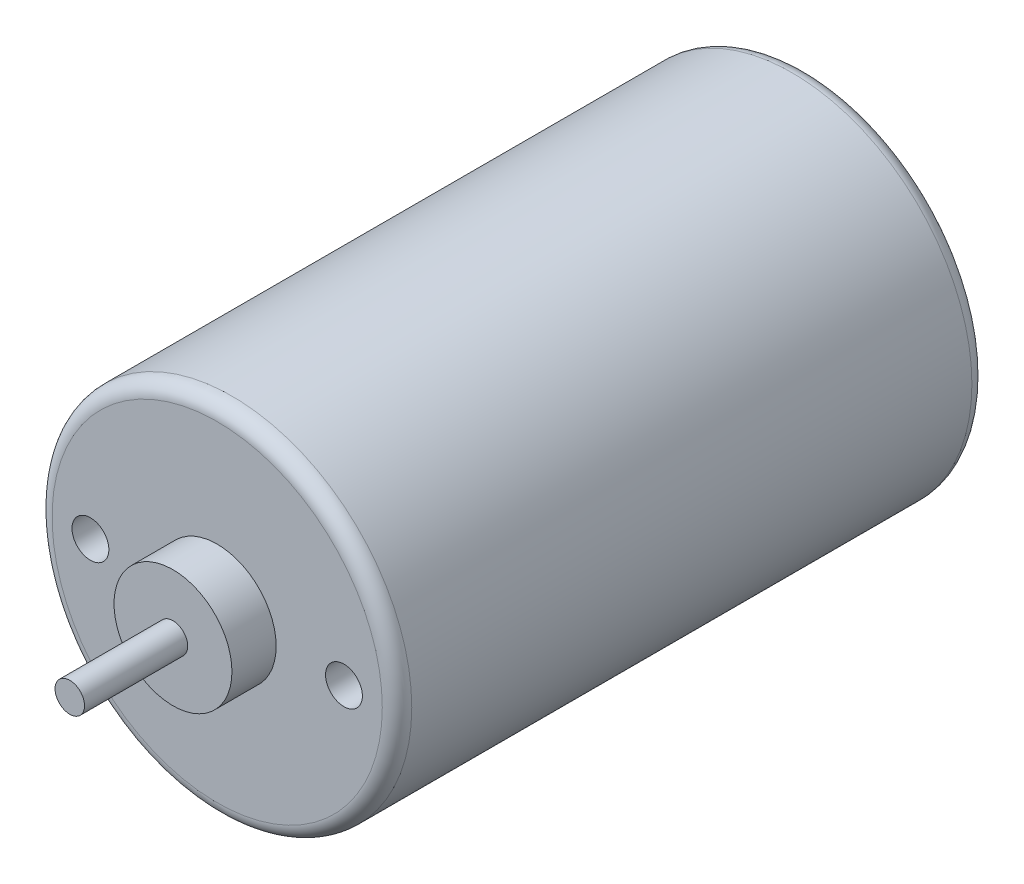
ISO-10303-21;
HEADER;
FILE_DESCRIPTION(('STEP AP214'),'2;1');
FILE_NAME('part.step','',(''),(''),'','','');
FILE_SCHEMA(('AUTOMOTIVE_DESIGN { 1 0 10303 214 1 1 1 1 }'));
ENDSEC;
DATA;
#1=APPLICATION_CONTEXT('core data for automotive mechanical design processes');
#2=APPLICATION_PROTOCOL_DEFINITION('international standard','automotive_design',2000,#1);
#3=PRODUCT_CONTEXT('',#1,'mechanical');
#4=PRODUCT('Part','Part','',(#3));
#5=PRODUCT_RELATED_PRODUCT_CATEGORY('part','',(#4));
#6=PRODUCT_DEFINITION_FORMATION('','',#4);
#7=PRODUCT_DEFINITION_CONTEXT('part definition',#1,'design');
#8=PRODUCT_DEFINITION('design','',#6,#7);
#9=PRODUCT_DEFINITION_SHAPE('','',#8);
#10=(LENGTH_UNIT() NAMED_UNIT(*) SI_UNIT(.MILLI.,.METRE.));
#11=(NAMED_UNIT(*) PLANE_ANGLE_UNIT() SI_UNIT($,.RADIAN.));
#12=(NAMED_UNIT(*) SI_UNIT($,.STERADIAN.) SOLID_ANGLE_UNIT());
#13=UNCERTAINTY_MEASURE_WITH_UNIT(LENGTH_MEASURE(1.E-05),#10,'distance_accuracy_value','');
#14=(GEOMETRIC_REPRESENTATION_CONTEXT(3) GLOBAL_UNCERTAINTY_ASSIGNED_CONTEXT((#13)) GLOBAL_UNIT_ASSIGNED_CONTEXT((#10,
#11,#12)) REPRESENTATION_CONTEXT('',''));
#15=CARTESIAN_POINT('',(0.,0.,0.));
#16=DIRECTION('',(0.,0.,1.));
#17=DIRECTION('',(1.,0.,0.));
#18=AXIS2_PLACEMENT_3D('',#15,#16,#17);
#19=CARTESIAN_POINT('',(0.,0.,40.));
#20=DIRECTION('',(0.,0.,-1.));
#21=DIRECTION('',(-1.,0.,0.));
#22=AXIS2_PLACEMENT_3D('',#19,#20,#21);
#23=CYLINDRICAL_SURFACE('',#22,12.2);
#24=CARTESIAN_POINT('',(0.,0.,1.));
#25=DIRECTION('',(0.,0.,1.));
#26=DIRECTION('',(1.,0.,0.));
#27=AXIS2_PLACEMENT_3D('',#24,#25,#26);
#28=CIRCLE('',#27,12.2);
#29=CARTESIAN_POINT('',(12.2,0.,1.));
#30=VERTEX_POINT('',#29);
#31=EDGE_CURVE('E46',#30,#30,#28,.T.);
#32=ORIENTED_EDGE('',*,*,#31,.T.);
#33=EDGE_LOOP('',(#32));
#34=FACE_BOUND('',#33,.T.);
#35=CARTESIAN_POINT('',(0.,0.,39.));
#36=DIRECTION('',(0.,0.,1.));
#37=DIRECTION('',(1.,0.,0.));
#38=AXIS2_PLACEMENT_3D('',#35,#36,#37);
#39=CIRCLE('',#38,12.2);
#40=CARTESIAN_POINT('',(12.2,0.,39.));
#41=VERTEX_POINT('',#40);
#42=EDGE_CURVE('E88',#41,#41,#39,.F.);
#43=ORIENTED_EDGE('',*,*,#42,.T.);
#44=EDGE_LOOP('',(#43));
#45=FACE_BOUND('',#44,.T.);
#46=ADVANCED_FACE('F38',(#34,#45),#23,.T.);
#47=CARTESIAN_POINT('',(0.,0.,40.));
#48=DIRECTION('',(0.,0.,1.));
#49=DIRECTION('',(1.,0.,0.));
#50=AXIS2_PLACEMENT_3D('',#47,#48,#49);
#51=PLANE('',#50);
#52=CARTESIAN_POINT('',(0.,0.,40.));
#53=DIRECTION('',(0.,0.,1.));
#54=DIRECTION('',(1.,0.,0.));
#55=AXIS2_PLACEMENT_3D('',#52,#53,#54);
#56=CIRCLE('',#55,11.2);
#57=CARTESIAN_POINT('',(11.2,0.,40.));
#58=VERTEX_POINT('',#57);
#59=EDGE_CURVE('E80',#58,#58,#56,.T.);
#60=ORIENTED_EDGE('',*,*,#59,.T.);
#61=EDGE_LOOP('',(#60));
#62=FACE_BOUND('',#61,.T.);
#63=CARTESIAN_POINT('',(-8.6,0.,40.));
#64=DIRECTION('',(0.,0.,1.));
#65=DIRECTION('',(1.,0.,0.));
#66=AXIS2_PLACEMENT_3D('',#63,#64,#65);
#67=CIRCLE('',#66,1.24999999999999);
#68=CARTESIAN_POINT('',(-7.35000000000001,0.,40.));
#69=VERTEX_POINT('',#68);
#70=EDGE_CURVE('E63',#69,#69,#67,.T.);
#71=ORIENTED_EDGE('',*,*,#70,.F.);
#72=EDGE_LOOP('',(#71));
#73=FACE_BOUND('',#72,.T.);
#74=CARTESIAN_POINT('',(8.6,0.,40.));
#75=DIRECTION('',(0.,0.,1.));
#76=DIRECTION('',(1.,0.,0.));
#77=AXIS2_PLACEMENT_3D('',#74,#75,#76);
#78=CIRCLE('',#77,1.24999999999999);
#79=CARTESIAN_POINT('',(9.84999999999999,0.,40.));
#80=VERTEX_POINT('',#79);
#81=EDGE_CURVE('E62',#80,#80,#78,.T.);
#82=ORIENTED_EDGE('',*,*,#81,.F.);
#83=EDGE_LOOP('',(#82));
#84=FACE_BOUND('',#83,.T.);
#85=CARTESIAN_POINT('',(0.,0.,40.));
#86=DIRECTION('',(0.,0.,1.));
#87=DIRECTION('',(1.,0.,0.));
#88=AXIS2_PLACEMENT_3D('',#85,#86,#87);
#89=CIRCLE('',#88,4.);
#90=CARTESIAN_POINT('',(4.,0.,40.));
#91=VERTEX_POINT('',#90);
#92=EDGE_CURVE('E81',#91,#91,#89,.T.);
#93=ORIENTED_EDGE('',*,*,#92,.F.);
#94=EDGE_LOOP('',(#93));
#95=FACE_BOUND('',#94,.T.);
#96=ADVANCED_FACE('F104',(#62,#73,#84,#95),#51,.T.);
#97=CARTESIAN_POINT('',(0.,0.,0.));
#98=DIRECTION('',(0.,0.,1.));
#99=DIRECTION('',(1.,0.,0.));
#100=AXIS2_PLACEMENT_3D('',#97,#98,#99);
#101=PLANE('',#100);
#102=CARTESIAN_POINT('',(0.,0.,0.));
#103=DIRECTION('',(0.,0.,1.));
#104=DIRECTION('',(1.,0.,0.));
#105=AXIS2_PLACEMENT_3D('',#102,#103,#104);
#106=CIRCLE('',#105,11.2);
#107=CARTESIAN_POINT('',(11.2,0.,0.));
#108=VERTEX_POINT('',#107);
#109=EDGE_CURVE('E11',#108,#108,#106,.F.);
#110=ORIENTED_EDGE('',*,*,#109,.T.);
#111=EDGE_LOOP('',(#110));
#112=FACE_BOUND('',#111,.T.);
#113=ADVANCED_FACE('F109',(#112),#101,.F.);
#114=CARTESIAN_POINT('',(0.,0.,43.));
#115=DIRECTION('',(0.,0.,-1.));
#116=DIRECTION('',(-1.,0.,0.));
#117=AXIS2_PLACEMENT_3D('',#114,#115,#116);
#118=CYLINDRICAL_SURFACE('',#117,4.);
#119=CARTESIAN_POINT('',(0.,0.,43.));
#120=DIRECTION('',(0.,0.,1.));
#121=DIRECTION('',(1.,0.,0.));
#122=AXIS2_PLACEMENT_3D('',#119,#120,#121);
#123=CIRCLE('',#122,4.);
#124=CARTESIAN_POINT('',(4.,0.,43.));
#125=VERTEX_POINT('',#124);
#126=EDGE_CURVE('E76',#125,#125,#123,.T.);
#127=ORIENTED_EDGE('',*,*,#126,.F.);
#128=EDGE_LOOP('',(#127));
#129=FACE_BOUND('',#128,.T.);
#130=ORIENTED_EDGE('',*,*,#92,.T.);
#131=EDGE_LOOP('',(#130));
#132=FACE_BOUND('',#131,.T.);
#133=ADVANCED_FACE('F114',(#129,#132),#118,.T.);
#134=CARTESIAN_POINT('',(0.,0.,43.));
#135=DIRECTION('',(0.,0.,1.));
#136=DIRECTION('',(1.,0.,0.));
#137=AXIS2_PLACEMENT_3D('',#134,#135,#136);
#138=PLANE('',#137);
#139=CARTESIAN_POINT('',(0.,0.,43.));
#140=DIRECTION('',(0.,0.,1.));
#141=DIRECTION('',(1.,0.,0.));
#142=AXIS2_PLACEMENT_3D('',#139,#140,#141);
#143=CIRCLE('',#142,1.);
#144=CARTESIAN_POINT('',(1.,0.,43.));
#145=VERTEX_POINT('',#144);
#146=EDGE_CURVE('E77',#145,#145,#143,.T.);
#147=ORIENTED_EDGE('',*,*,#146,.F.);
#148=EDGE_LOOP('',(#147));
#149=FACE_BOUND('',#148,.T.);
#150=ORIENTED_EDGE('',*,*,#126,.T.);
#151=EDGE_LOOP('',(#150));
#152=FACE_BOUND('',#151,.T.);
#153=ADVANCED_FACE('F119',(#149,#152),#138,.T.);
#154=CARTESIAN_POINT('',(0.,0.,50.));
#155=DIRECTION('',(0.,0.,-1.));
#156=DIRECTION('',(-1.,0.,0.));
#157=AXIS2_PLACEMENT_3D('',#154,#155,#156);
#158=CYLINDRICAL_SURFACE('',#157,1.);
#159=CARTESIAN_POINT('',(0.,0.,50.));
#160=DIRECTION('',(0.,0.,1.));
#161=DIRECTION('',(1.,0.,0.));
#162=AXIS2_PLACEMENT_3D('',#159,#160,#161);
#163=CIRCLE('',#162,1.);
#164=CARTESIAN_POINT('',(1.,0.,50.));
#165=VERTEX_POINT('',#164);
#166=EDGE_CURVE('E73',#165,#165,#163,.T.);
#167=ORIENTED_EDGE('',*,*,#166,.F.);
#168=EDGE_LOOP('',(#167));
#169=FACE_BOUND('',#168,.T.);
#170=ORIENTED_EDGE('',*,*,#146,.T.);
#171=EDGE_LOOP('',(#170));
#172=FACE_BOUND('',#171,.T.);
#173=ADVANCED_FACE('F123',(#169,#172),#158,.T.);
#174=CARTESIAN_POINT('',(0.,0.,50.));
#175=DIRECTION('',(0.,0.,1.));
#176=DIRECTION('',(1.,0.,0.));
#177=AXIS2_PLACEMENT_3D('',#174,#175,#176);
#178=PLANE('',#177);
#179=ORIENTED_EDGE('',*,*,#166,.T.);
#180=EDGE_LOOP('',(#179));
#181=FACE_BOUND('',#180,.T.);
#182=ADVANCED_FACE('F127',(#181),#178,.T.);
#183=CARTESIAN_POINT('',(8.6,0.,36.));
#184=DIRECTION('',(0.,0.,1.));
#185=DIRECTION('',(1.,0.,0.));
#186=AXIS2_PLACEMENT_3D('',#183,#184,#185);
#187=CONICAL_SURFACE('',#186,1.25,1.02974425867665);
#188=CARTESIAN_POINT('',(8.6,0.,35.2489242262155));
#189=VERTEX_POINT('',#188);
#190=VERTEX_LOOP('',#189);
#191=FACE_BOUND('',#190,.T.);
#192=CARTESIAN_POINT('',(8.6,0.,36.));
#193=DIRECTION('',(0.,0.,1.));
#194=DIRECTION('',(1.,0.,0.));
#195=AXIS2_PLACEMENT_3D('',#192,#193,#194);
#196=CIRCLE('',#195,1.25);
#197=CARTESIAN_POINT('',(9.85,0.,36.));
#198=VERTEX_POINT('',#197);
#199=EDGE_CURVE('E66',#198,#198,#196,.T.);
#200=ORIENTED_EDGE('',*,*,#199,.T.);
#201=EDGE_LOOP('',(#200));
#202=FACE_BOUND('',#201,.T.);
#203=ADVANCED_FACE('F131',(#191,#202),#187,.F.);
#204=CARTESIAN_POINT('',(8.6,0.,40.));
#205=DIRECTION('',(0.,0.,1.));
#206=DIRECTION('',(1.,0.,0.));
#207=AXIS2_PLACEMENT_3D('',#204,#205,#206);
#208=CYLINDRICAL_SURFACE('',#207,1.24999999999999);
#209=ORIENTED_EDGE('',*,*,#199,.F.);
#210=EDGE_LOOP('',(#209));
#211=FACE_BOUND('',#210,.T.);
#212=ORIENTED_EDGE('',*,*,#81,.T.);
#213=EDGE_LOOP('',(#212));
#214=FACE_BOUND('',#213,.T.);
#215=ADVANCED_FACE('F56',(#211,#214),#208,.F.);
#216=CARTESIAN_POINT('',(-8.6,0.,36.));
#217=DIRECTION('',(0.,0.,1.));
#218=DIRECTION('',(1.,0.,0.));
#219=AXIS2_PLACEMENT_3D('',#216,#217,#218);
#220=CONICAL_SURFACE('',#219,1.25,1.02974425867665);
#221=CARTESIAN_POINT('',(-8.6,0.,35.2489242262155));
#222=VERTEX_POINT('',#221);
#223=VERTEX_LOOP('',#222);
#224=FACE_BOUND('',#223,.T.);
#225=CARTESIAN_POINT('',(-8.6,0.,36.));
#226=DIRECTION('',(0.,0.,1.));
#227=DIRECTION('',(1.,0.,0.));
#228=AXIS2_PLACEMENT_3D('',#225,#226,#227);
#229=CIRCLE('',#228,1.25);
#230=CARTESIAN_POINT('',(-7.35,0.,36.));
#231=VERTEX_POINT('',#230);
#232=EDGE_CURVE('E60',#231,#231,#229,.T.);
#233=ORIENTED_EDGE('',*,*,#232,.T.);
#234=EDGE_LOOP('',(#233));
#235=FACE_BOUND('',#234,.T.);
#236=ADVANCED_FACE('F52',(#224,#235),#220,.F.);
#237=CARTESIAN_POINT('',(-8.6,0.,40.));
#238=DIRECTION('',(0.,0.,1.));
#239=DIRECTION('',(1.,0.,0.));
#240=AXIS2_PLACEMENT_3D('',#237,#238,#239);
#241=CYLINDRICAL_SURFACE('',#240,1.24999999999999);
#242=ORIENTED_EDGE('',*,*,#232,.F.);
#243=EDGE_LOOP('',(#242));
#244=FACE_BOUND('',#243,.T.);
#245=ORIENTED_EDGE('',*,*,#70,.T.);
#246=EDGE_LOOP('',(#245));
#247=FACE_BOUND('',#246,.T.);
#248=ADVANCED_FACE('F55',(#244,#247),#241,.F.);
#249=CARTESIAN_POINT('',(0.,0.,39.));
#250=DIRECTION('',(0.,0.,1.));
#251=DIRECTION('',(1.,0.,0.));
#252=AXIS2_PLACEMENT_3D('',#249,#250,#251);
#253=TOROIDAL_SURFACE('',#252,11.2,1.);
#254=ORIENTED_EDGE('',*,*,#42,.F.);
#255=EDGE_LOOP('',(#254));
#256=FACE_BOUND('',#255,.T.);
#257=ORIENTED_EDGE('',*,*,#59,.F.);
#258=EDGE_LOOP('',(#257));
#259=FACE_BOUND('',#258,.T.);
#260=ADVANCED_FACE('F96',(#256,#259),#253,.T.);
#261=CARTESIAN_POINT('',(0.,0.,1.));
#262=DIRECTION('',(0.,0.,1.));
#263=DIRECTION('',(1.,0.,0.));
#264=AXIS2_PLACEMENT_3D('',#261,#262,#263);
#265=TOROIDAL_SURFACE('',#264,11.2,1.);
#266=ORIENTED_EDGE('',*,*,#109,.F.);
#267=EDGE_LOOP('',(#266));
#268=FACE_BOUND('',#267,.T.);
#269=ORIENTED_EDGE('',*,*,#31,.F.);
#270=EDGE_LOOP('',(#269));
#271=FACE_BOUND('',#270,.T.);
#272=ADVANCED_FACE('F40',(#268,#271),#265,.T.);
#273=CLOSED_SHELL('',(#46,#96,#113,#133,#153,#173,#182,#203,#215,#236,#248,#260,#272));
#274=MANIFOLD_SOLID_BREP('B2',#273);
#275=ADVANCED_BREP_SHAPE_REPRESENTATION('',(#18,#274),#14);
#276=SHAPE_DEFINITION_REPRESENTATION(#9,#275);
ENDSEC;
END-ISO-10303-21;
